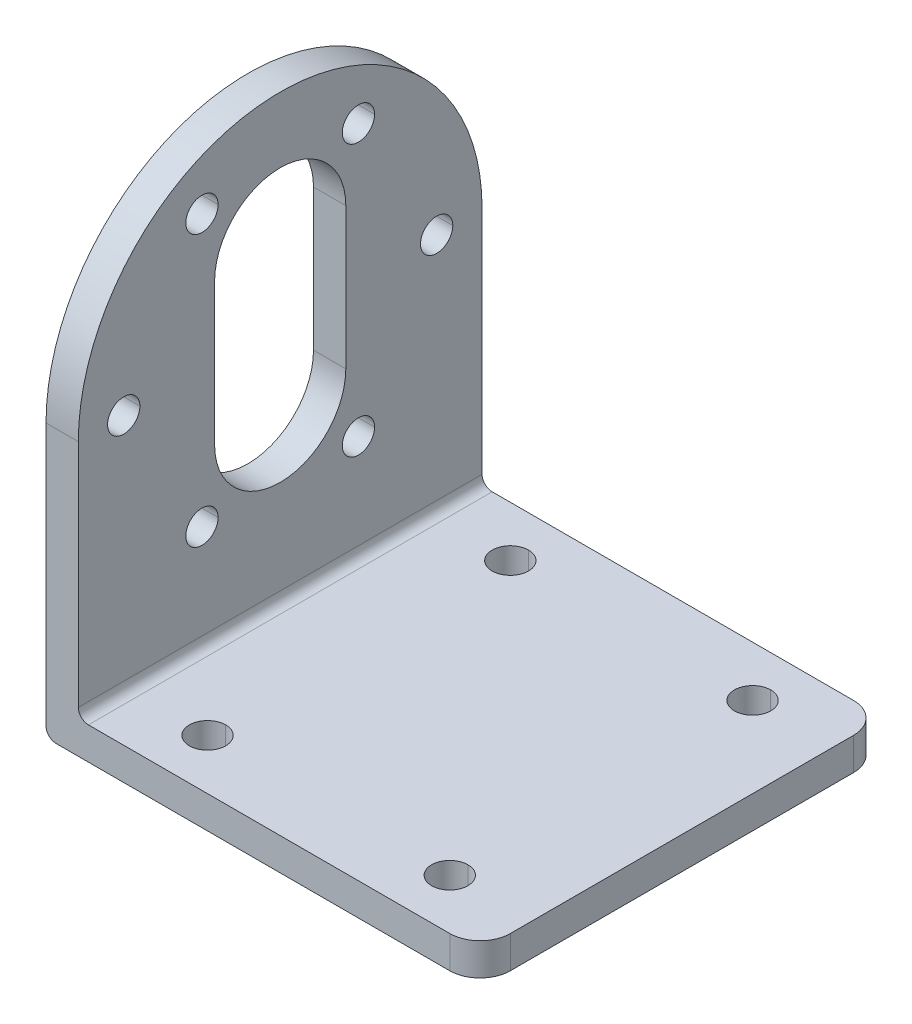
ISO-10303-21;
HEADER;
FILE_DESCRIPTION(('STEP AP214'),'2;1');
FILE_NAME('part.step','',(''),(''),'','','');
FILE_SCHEMA(('AUTOMOTIVE_DESIGN { 1 0 10303 214 1 1 1 1 }'));
ENDSEC;
DATA;
#1=APPLICATION_CONTEXT('core data for automotive mechanical design processes');
#2=APPLICATION_PROTOCOL_DEFINITION('international standard','automotive_design',2000,#1);
#3=PRODUCT_CONTEXT('',#1,'mechanical');
#4=PRODUCT('Part','Part','',(#3));
#5=PRODUCT_RELATED_PRODUCT_CATEGORY('part','',(#4));
#6=PRODUCT_DEFINITION_FORMATION('','',#4);
#7=PRODUCT_DEFINITION_CONTEXT('part definition',#1,'design');
#8=PRODUCT_DEFINITION('design','',#6,#7);
#9=PRODUCT_DEFINITION_SHAPE('','',#8);
#10=(LENGTH_UNIT() NAMED_UNIT(*) SI_UNIT(.MILLI.,.METRE.));
#11=(NAMED_UNIT(*) PLANE_ANGLE_UNIT() SI_UNIT($,.RADIAN.));
#12=(NAMED_UNIT(*) SI_UNIT($,.STERADIAN.) SOLID_ANGLE_UNIT());
#13=UNCERTAINTY_MEASURE_WITH_UNIT(LENGTH_MEASURE(1.E-05),#10,'distance_accuracy_value','');
#14=(GEOMETRIC_REPRESENTATION_CONTEXT(3) GLOBAL_UNCERTAINTY_ASSIGNED_CONTEXT((#13)) GLOBAL_UNIT_ASSIGNED_CONTEXT((#10,
#11,#12)) REPRESENTATION_CONTEXT('',''));
#15=CARTESIAN_POINT('',(0.,0.,0.));
#16=DIRECTION('',(0.,0.,1.));
#17=DIRECTION('',(1.,0.,0.));
#18=AXIS2_PLACEMENT_3D('',#15,#16,#17);
#19=CARTESIAN_POINT('',(-20.5,1.,20.));
#20=DIRECTION('',(0.,0.,-1.));
#21=DIRECTION('',(-1.,0.,0.));
#22=AXIS2_PLACEMENT_3D('',#19,#20,#21);
#23=CYLINDRICAL_SURFACE('',#22,1.);
#24=CARTESIAN_POINT('',(-20.5,1.,-20.));
#25=DIRECTION('',(0.,0.,-1.));
#26=DIRECTION('',(1.,0.,0.));
#27=AXIS2_PLACEMENT_3D('',#24,#25,#26);
#28=CIRCLE('',#27,1.);
#29=CARTESIAN_POINT('',(-20.5,0.,-20.));
#30=VERTEX_POINT('',#29);
#31=CARTESIAN_POINT('',(-21.5,1.,-20.));
#32=VERTEX_POINT('',#31);
#33=EDGE_CURVE('E359',#30,#32,#28,.T.);
#34=ORIENTED_EDGE('',*,*,#33,.F.);
#35=DIRECTION('',(0.,0.,-1.));
#36=VECTOR('',#35,1.);
#37=CARTESIAN_POINT('',(-20.5,0.,-20.));
#38=LINE('',#37,#36);
#39=CARTESIAN_POINT('',(-20.5,0.,20.));
#40=VERTEX_POINT('',#39);
#41=EDGE_CURVE('E369',#40,#30,#38,.T.);
#42=ORIENTED_EDGE('',*,*,#41,.F.);
#43=CARTESIAN_POINT('',(-20.5,1.,20.));
#44=DIRECTION('',(0.,0.,1.));
#45=DIRECTION('',(-1.,0.,0.));
#46=AXIS2_PLACEMENT_3D('',#43,#44,#45);
#47=CIRCLE('',#46,1.);
#48=CARTESIAN_POINT('',(-21.5,1.,20.));
#49=VERTEX_POINT('',#48);
#50=EDGE_CURVE('E492',#49,#40,#47,.T.);
#51=ORIENTED_EDGE('',*,*,#50,.F.);
#52=DIRECTION('',(0.,0.,1.));
#53=VECTOR('',#52,1.);
#54=CARTESIAN_POINT('',(-21.5,1.,20.));
#55=LINE('',#54,#53);
#56=EDGE_CURVE('E447',#32,#49,#55,.T.);
#57=ORIENTED_EDGE('',*,*,#56,.F.);
#58=EDGE_LOOP('',(#34,#42,#51,#57));
#59=FACE_BOUND('',#58,.T.);
#60=ADVANCED_FACE('F16',(#59),#23,.T.);
#61=CARTESIAN_POINT('',(-17.3,4.2,20.));
#62=DIRECTION('',(0.,0.,1.));
#63=DIRECTION('',(1.,0.,0.));
#64=AXIS2_PLACEMENT_3D('',#61,#62,#63);
#65=CYLINDRICAL_SURFACE('',#64,1.);
#66=CARTESIAN_POINT('',(-17.3,4.2,20.));
#67=DIRECTION('',(0.,0.,-1.));
#68=DIRECTION('',(-1.,0.,0.));
#69=AXIS2_PLACEMENT_3D('',#66,#67,#68);
#70=CIRCLE('',#69,1.);
#71=CARTESIAN_POINT('',(-17.3,3.2,20.));
#72=VERTEX_POINT('',#71);
#73=CARTESIAN_POINT('',(-18.3,4.2,20.));
#74=VERTEX_POINT('',#73);
#75=EDGE_CURVE('E510',#72,#74,#70,.T.);
#76=ORIENTED_EDGE('',*,*,#75,.F.);
#77=DIRECTION('',(0.,0.,1.));
#78=VECTOR('',#77,1.);
#79=CARTESIAN_POINT('',(-17.3,3.2,20.));
#80=LINE('',#79,#78);
#81=CARTESIAN_POINT('',(-17.3,3.2,-20.));
#82=VERTEX_POINT('',#81);
#83=EDGE_CURVE('E398',#82,#72,#80,.T.);
#84=ORIENTED_EDGE('',*,*,#83,.F.);
#85=CARTESIAN_POINT('',(-17.3,4.2,-20.));
#86=DIRECTION('',(0.,0.,1.));
#87=DIRECTION('',(1.,0.,0.));
#88=AXIS2_PLACEMENT_3D('',#85,#86,#87);
#89=CIRCLE('',#88,1.);
#90=CARTESIAN_POINT('',(-18.3,4.2,-20.));
#91=VERTEX_POINT('',#90);
#92=EDGE_CURVE('E439',#91,#82,#89,.T.);
#93=ORIENTED_EDGE('',*,*,#92,.F.);
#94=DIRECTION('',(0.,0.,-1.));
#95=VECTOR('',#94,1.);
#96=CARTESIAN_POINT('',(-18.3,4.2,-20.));
#97=LINE('',#96,#95);
#98=EDGE_CURVE('E186',#74,#91,#97,.T.);
#99=ORIENTED_EDGE('',*,*,#98,.F.);
#100=EDGE_LOOP('',(#76,#84,#93,#99));
#101=FACE_BOUND('',#100,.T.);
#102=ADVANCED_FACE('F601',(#101),#65,.F.);
#103=CARTESIAN_POINT('',(-21.501,27.,15.4999999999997));
#104=DIRECTION('',(1.,0.,0.));
#105=DIRECTION('',(0.,0.,-1.));
#106=AXIS2_PLACEMENT_3D('',#103,#104,#105);
#107=CYLINDRICAL_SURFACE('',#106,1.6);
#108=DIRECTION('',(1.,0.,0.));
#109=VECTOR('',#108,1.);
#110=CARTESIAN_POINT('',(-21.501,27.,17.0999999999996));
#111=LINE('',#110,#109);
#112=CARTESIAN_POINT('',(-21.5,27.,17.0999999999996));
#113=VERTEX_POINT('',#112);
#114=CARTESIAN_POINT('',(-18.3,27.,17.0999999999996));
#115=VERTEX_POINT('',#114);
#116=EDGE_CURVE('E726',#113,#115,#111,.T.);
#117=ORIENTED_EDGE('',*,*,#116,.F.);
#118=CARTESIAN_POINT('',(-21.5,27.,15.4999999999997));
#119=DIRECTION('',(-1.,0.,0.));
#120=DIRECTION('',(0.,0.,-1.));
#121=AXIS2_PLACEMENT_3D('',#118,#119,#120);
#122=CIRCLE('',#121,1.6);
#123=CARTESIAN_POINT('',(-21.5,27.,13.8999999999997));
#124=VERTEX_POINT('',#123);
#125=EDGE_CURVE('E458',#113,#124,#122,.T.);
#126=ORIENTED_EDGE('',*,*,#125,.T.);
#127=DIRECTION('',(1.,0.,0.));
#128=VECTOR('',#127,1.);
#129=CARTESIAN_POINT('',(-21.501,27.,13.8999999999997));
#130=LINE('',#129,#128);
#131=CARTESIAN_POINT('',(-18.3,27.,13.8999999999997));
#132=VERTEX_POINT('',#131);
#133=EDGE_CURVE('E657',#124,#132,#130,.T.);
#134=ORIENTED_EDGE('',*,*,#133,.T.);
#135=CARTESIAN_POINT('',(-18.3,27.,15.4999999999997));
#136=DIRECTION('',(1.,0.,0.));
#137=DIRECTION('',(0.,0.,-1.));
#138=AXIS2_PLACEMENT_3D('',#135,#136,#137);
#139=CIRCLE('',#138,1.6);
#140=EDGE_CURVE('E479',#132,#115,#139,.T.);
#141=ORIENTED_EDGE('',*,*,#140,.T.);
#142=EDGE_LOOP('',(#117,#126,#134,#141));
#143=FACE_BOUND('',#142,.T.);
#144=ADVANCED_FACE('F739',(#143),#107,.F.);
#145=CARTESIAN_POINT('',(-21.501,13.5766062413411,7.74999999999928));
#146=DIRECTION('',(1.,0.,0.));
#147=DIRECTION('',(0.,0.,-1.));
#148=AXIS2_PLACEMENT_3D('',#145,#146,#147);
#149=CYLINDRICAL_SURFACE('',#148,1.6);
#150=DIRECTION('',(1.,0.,0.));
#151=VECTOR('',#150,1.);
#152=CARTESIAN_POINT('',(-21.501,13.5766062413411,9.34999999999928));
#153=LINE('',#152,#151);
#154=CARTESIAN_POINT('',(-21.5,13.5766062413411,9.34999999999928));
#155=VERTEX_POINT('',#154);
#156=CARTESIAN_POINT('',(-18.3,13.5766062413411,9.34999999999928));
#157=VERTEX_POINT('',#156);
#158=EDGE_CURVE('E660',#155,#157,#153,.T.);
#159=ORIENTED_EDGE('',*,*,#158,.F.);
#160=CARTESIAN_POINT('',(-21.5,13.5766062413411,7.74999999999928));
#161=DIRECTION('',(-1.,0.,0.));
#162=DIRECTION('',(0.,0.,-1.));
#163=AXIS2_PLACEMENT_3D('',#160,#161,#162);
#164=CIRCLE('',#163,1.6);
#165=CARTESIAN_POINT('',(-21.5,13.5766062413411,6.14999999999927));
#166=VERTEX_POINT('',#165);
#167=EDGE_CURVE('E465',#155,#166,#164,.T.);
#168=ORIENTED_EDGE('',*,*,#167,.T.);
#169=DIRECTION('',(1.,0.,0.));
#170=VECTOR('',#169,1.);
#171=CARTESIAN_POINT('',(-21.501,13.5766062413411,6.14999999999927));
#172=LINE('',#171,#170);
#173=CARTESIAN_POINT('',(-18.3,13.5766062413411,6.14999999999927));
#174=VERTEX_POINT('',#173);
#175=EDGE_CURVE('E671',#166,#174,#172,.T.);
#176=ORIENTED_EDGE('',*,*,#175,.T.);
#177=CARTESIAN_POINT('',(-18.3,13.5766062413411,7.74999999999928));
#178=DIRECTION('',(1.,0.,0.));
#179=DIRECTION('',(0.,0.,-1.));
#180=AXIS2_PLACEMENT_3D('',#177,#178,#179);
#181=CIRCLE('',#180,1.6);
#182=EDGE_CURVE('E474',#174,#157,#181,.T.);
#183=ORIENTED_EDGE('',*,*,#182,.T.);
#184=EDGE_LOOP('',(#159,#168,#176,#183));
#185=FACE_BOUND('',#184,.T.);
#186=ADVANCED_FACE('F822',(#185),#149,.F.);
#187=CARTESIAN_POINT('',(-21.501,13.5766062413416,-7.75000000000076));
#188=DIRECTION('',(1.,0.,0.));
#189=DIRECTION('',(0.,0.,-1.));
#190=AXIS2_PLACEMENT_3D('',#187,#188,#189);
#191=CYLINDRICAL_SURFACE('',#190,1.6);
#192=DIRECTION('',(1.,0.,0.));
#193=VECTOR('',#192,1.);
#194=CARTESIAN_POINT('',(-21.501,13.5766062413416,-6.15000000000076));
#195=LINE('',#194,#193);
#196=CARTESIAN_POINT('',(-21.5,13.5766062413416,-6.15000000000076));
#197=VERTEX_POINT('',#196);
#198=CARTESIAN_POINT('',(-18.3,13.5766062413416,-6.15000000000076));
#199=VERTEX_POINT('',#198);
#200=EDGE_CURVE('E668',#197,#199,#195,.T.);
#201=ORIENTED_EDGE('',*,*,#200,.F.);
#202=CARTESIAN_POINT('',(-21.5,13.5766062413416,-7.75000000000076));
#203=DIRECTION('',(-1.,0.,0.));
#204=DIRECTION('',(0.,0.,-1.));
#205=AXIS2_PLACEMENT_3D('',#202,#203,#204);
#206=CIRCLE('',#205,1.6);
#207=CARTESIAN_POINT('',(-21.5,13.5766062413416,-9.35000000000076));
#208=VERTEX_POINT('',#207);
#209=EDGE_CURVE('E466',#197,#208,#206,.T.);
#210=ORIENTED_EDGE('',*,*,#209,.T.);
#211=DIRECTION('',(1.,0.,0.));
#212=VECTOR('',#211,1.);
#213=CARTESIAN_POINT('',(-21.501,13.5766062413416,-9.35000000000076));
#214=LINE('',#213,#212);
#215=CARTESIAN_POINT('',(-18.3,13.5766062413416,-9.35000000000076));
#216=VERTEX_POINT('',#215);
#217=EDGE_CURVE('E662',#208,#216,#214,.T.);
#218=ORIENTED_EDGE('',*,*,#217,.T.);
#219=CARTESIAN_POINT('',(-18.3,13.5766062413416,-7.75000000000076));
#220=DIRECTION('',(1.,0.,0.));
#221=DIRECTION('',(0.,0.,-1.));
#222=AXIS2_PLACEMENT_3D('',#219,#220,#221);
#223=CIRCLE('',#222,1.6);
#224=EDGE_CURVE('E476',#216,#199,#223,.T.);
#225=ORIENTED_EDGE('',*,*,#224,.T.);
#226=EDGE_LOOP('',(#201,#210,#218,#225));
#227=FACE_BOUND('',#226,.T.);
#228=ADVANCED_FACE('F1345',(#227),#191,.F.);
#229=CARTESIAN_POINT('',(-21.501,27.0000000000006,-15.5000000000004));
#230=DIRECTION('',(1.,0.,0.));
#231=DIRECTION('',(0.,0.,-1.));
#232=AXIS2_PLACEMENT_3D('',#229,#230,#231);
#233=CYLINDRICAL_SURFACE('',#232,1.6);
#234=DIRECTION('',(1.,0.,0.));
#235=VECTOR('',#234,1.);
#236=CARTESIAN_POINT('',(-21.501,27.0000000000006,-13.9000000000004));
#237=LINE('',#236,#235);
#238=CARTESIAN_POINT('',(-21.5,27.0000000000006,-13.9000000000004));
#239=VERTEX_POINT('',#238);
#240=CARTESIAN_POINT('',(-18.3,27.0000000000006,-13.9000000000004));
#241=VERTEX_POINT('',#240);
#242=EDGE_CURVE('E694',#239,#241,#237,.T.);
#243=ORIENTED_EDGE('',*,*,#242,.F.);
#244=CARTESIAN_POINT('',(-21.5,27.0000000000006,-15.5000000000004));
#245=DIRECTION('',(-1.,0.,0.));
#246=DIRECTION('',(0.,0.,-1.));
#247=AXIS2_PLACEMENT_3D('',#244,#245,#246);
#248=CIRCLE('',#247,1.6);
#249=CARTESIAN_POINT('',(-21.5,27.0000000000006,-17.1000000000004));
#250=VERTEX_POINT('',#249);
#251=EDGE_CURVE('E467',#239,#250,#248,.T.);
#252=ORIENTED_EDGE('',*,*,#251,.T.);
#253=DIRECTION('',(1.,0.,0.));
#254=VECTOR('',#253,1.);
#255=CARTESIAN_POINT('',(-21.501,27.0000000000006,-17.1000000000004));
#256=LINE('',#255,#254);
#257=CARTESIAN_POINT('',(-18.3,27.0000000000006,-17.1000000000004));
#258=VERTEX_POINT('',#257);
#259=EDGE_CURVE('E633',#250,#258,#256,.T.);
#260=ORIENTED_EDGE('',*,*,#259,.T.);
#261=CARTESIAN_POINT('',(-18.3,27.0000000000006,-15.5000000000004));
#262=DIRECTION('',(1.,0.,0.));
#263=DIRECTION('',(0.,0.,-1.));
#264=AXIS2_PLACEMENT_3D('',#261,#262,#263);
#265=CIRCLE('',#264,1.6);
#266=EDGE_CURVE('E535',#258,#241,#265,.T.);
#267=ORIENTED_EDGE('',*,*,#266,.T.);
#268=EDGE_LOOP('',(#243,#252,#260,#267));
#269=FACE_BOUND('',#268,.T.);
#270=ADVANCED_FACE('F716',(#269),#233,.F.);
#271=CARTESIAN_POINT('',(-21.501,40.4233937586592,-7.75));
#272=DIRECTION('',(1.,0.,0.));
#273=DIRECTION('',(0.,0.,-1.));
#274=AXIS2_PLACEMENT_3D('',#271,#272,#273);
#275=CYLINDRICAL_SURFACE('',#274,1.6);
#276=DIRECTION('',(1.,0.,0.));
#277=VECTOR('',#276,1.);
#278=CARTESIAN_POINT('',(-21.501,40.4233937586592,-6.15));
#279=LINE('',#278,#277);
#280=CARTESIAN_POINT('',(-21.5,40.4233937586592,-6.15));
#281=VERTEX_POINT('',#280);
#282=CARTESIAN_POINT('',(-18.3,40.4233937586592,-6.15));
#283=VERTEX_POINT('',#282);
#284=EDGE_CURVE('E635',#281,#283,#279,.T.);
#285=ORIENTED_EDGE('',*,*,#284,.F.);
#286=CARTESIAN_POINT('',(-21.5,40.4233937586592,-7.75));
#287=DIRECTION('',(-1.,0.,0.));
#288=DIRECTION('',(0.,0.,-1.));
#289=AXIS2_PLACEMENT_3D('',#286,#287,#288);
#290=CIRCLE('',#289,1.6);
#291=CARTESIAN_POINT('',(-21.5,40.4233937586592,-9.35));
#292=VERTEX_POINT('',#291);
#293=EDGE_CURVE('E475',#281,#292,#290,.T.);
#294=ORIENTED_EDGE('',*,*,#293,.T.);
#295=DIRECTION('',(1.,0.,0.));
#296=VECTOR('',#295,1.);
#297=CARTESIAN_POINT('',(-21.501,40.4233937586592,-9.35));
#298=LINE('',#297,#296);
#299=CARTESIAN_POINT('',(-18.3,40.4233937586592,-9.35));
#300=VERTEX_POINT('',#299);
#301=EDGE_CURVE('E562',#292,#300,#298,.T.);
#302=ORIENTED_EDGE('',*,*,#301,.T.);
#303=CARTESIAN_POINT('',(-18.3,40.4233937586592,-7.75));
#304=DIRECTION('',(1.,0.,0.));
#305=DIRECTION('',(0.,0.,-1.));
#306=AXIS2_PLACEMENT_3D('',#303,#304,#305);
#307=CIRCLE('',#306,1.6);
#308=EDGE_CURVE('E518',#300,#283,#307,.T.);
#309=ORIENTED_EDGE('',*,*,#308,.T.);
#310=EDGE_LOOP('',(#285,#294,#302,#309));
#311=FACE_BOUND('',#310,.T.);
#312=ADVANCED_FACE('F1326',(#311),#275,.F.);
#313=CARTESIAN_POINT('',(-21.501,40.4233937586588,7.75));
#314=DIRECTION('',(1.,0.,0.));
#315=DIRECTION('',(0.,0.,-1.));
#316=AXIS2_PLACEMENT_3D('',#313,#314,#315);
#317=CYLINDRICAL_SURFACE('',#316,1.6);
#318=DIRECTION('',(1.,0.,0.));
#319=VECTOR('',#318,1.);
#320=CARTESIAN_POINT('',(-21.501,40.4233937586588,9.35));
#321=LINE('',#320,#319);
#322=CARTESIAN_POINT('',(-21.5,40.4233937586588,9.35));
#323=VERTEX_POINT('',#322);
#324=CARTESIAN_POINT('',(-18.3,40.4233937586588,9.35));
#325=VERTEX_POINT('',#324);
#326=EDGE_CURVE('E560',#323,#325,#321,.T.);
#327=ORIENTED_EDGE('',*,*,#326,.F.);
#328=CARTESIAN_POINT('',(-21.5,40.4233937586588,7.75));
#329=DIRECTION('',(-1.,0.,0.));
#330=DIRECTION('',(0.,0.,-1.));
#331=AXIS2_PLACEMENT_3D('',#328,#329,#330);
#332=CIRCLE('',#331,1.6);
#333=CARTESIAN_POINT('',(-21.5,40.4233937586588,6.15));
#334=VERTEX_POINT('',#333);
#335=EDGE_CURVE('E469',#323,#334,#332,.T.);
#336=ORIENTED_EDGE('',*,*,#335,.T.);
#337=DIRECTION('',(1.,0.,0.));
#338=VECTOR('',#337,1.);
#339=CARTESIAN_POINT('',(-21.501,40.4233937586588,6.15));
#340=LINE('',#339,#338);
#341=CARTESIAN_POINT('',(-18.3,40.4233937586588,6.15));
#342=VERTEX_POINT('',#341);
#343=EDGE_CURVE('E567',#334,#342,#340,.T.);
#344=ORIENTED_EDGE('',*,*,#343,.T.);
#345=CARTESIAN_POINT('',(-18.3,40.4233937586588,7.75));
#346=DIRECTION('',(1.,0.,0.));
#347=DIRECTION('',(0.,0.,-1.));
#348=AXIS2_PLACEMENT_3D('',#345,#346,#347);
#349=CIRCLE('',#348,1.6);
#350=EDGE_CURVE('E426',#342,#325,#349,.T.);
#351=ORIENTED_EDGE('',*,*,#350,.T.);
#352=EDGE_LOOP('',(#327,#336,#344,#351));
#353=FACE_BOUND('',#352,.T.);
#354=ADVANCED_FACE('F1317',(#353),#317,.F.);
#355=CARTESIAN_POINT('',(-21.501,34.,6.5));
#356=DIRECTION('',(0.,0.,1.));
#357=DIRECTION('',(1.,0.,0.));
#358=AXIS2_PLACEMENT_3D('',#355,#356,#357);
#359=PLANE('',#358);
#360=DIRECTION('',(0.,1.,0.));
#361=VECTOR('',#360,1.);
#362=CARTESIAN_POINT('',(-21.5,34.,6.5));
#363=LINE('',#362,#361);
#364=CARTESIAN_POINT('',(-21.5,20.,6.5));
#365=VERTEX_POINT('',#364);
#366=CARTESIAN_POINT('',(-21.5,34.,6.5));
#367=VERTEX_POINT('',#366);
#368=EDGE_CURVE('E486',#365,#367,#363,.T.);
#369=ORIENTED_EDGE('',*,*,#368,.T.);
#370=DIRECTION('',(1.,0.,0.));
#371=VECTOR('',#370,1.);
#372=CARTESIAN_POINT('',(-21.501,34.,6.5));
#373=LINE('',#372,#371);
#374=CARTESIAN_POINT('',(-18.3,34.,6.5));
#375=VERTEX_POINT('',#374);
#376=EDGE_CURVE('E94',#367,#375,#373,.T.);
#377=ORIENTED_EDGE('',*,*,#376,.T.);
#378=DIRECTION('',(0.,-1.,0.));
#379=VECTOR('',#378,1.);
#380=CARTESIAN_POINT('',(-18.3,34.,6.5));
#381=LINE('',#380,#379);
#382=CARTESIAN_POINT('',(-18.3,20.,6.5));
#383=VERTEX_POINT('',#382);
#384=EDGE_CURVE('E425',#375,#383,#381,.T.);
#385=ORIENTED_EDGE('',*,*,#384,.T.);
#386=DIRECTION('',(1.,0.,0.));
#387=VECTOR('',#386,1.);
#388=CARTESIAN_POINT('',(-21.501,20.,6.5));
#389=LINE('',#388,#387);
#390=EDGE_CURVE('E10',#365,#383,#389,.T.);
#391=ORIENTED_EDGE('',*,*,#390,.F.);
#392=EDGE_LOOP('',(#369,#377,#385,#391));
#393=FACE_BOUND('',#392,.T.);
#394=ADVANCED_FACE('F1309',(#393),#359,.F.);
#395=CARTESIAN_POINT('',(-21.501,20.,0.));
#396=DIRECTION('',(1.,0.,0.));
#397=DIRECTION('',(0.,0.,-1.));
#398=AXIS2_PLACEMENT_3D('',#395,#396,#397);
#399=CYLINDRICAL_SURFACE('',#398,6.5);
#400=CARTESIAN_POINT('',(-21.5,20.,0.));
#401=DIRECTION('',(-1.,0.,0.));
#402=DIRECTION('',(0.,0.,-1.));
#403=AXIS2_PLACEMENT_3D('',#400,#401,#402);
#404=CIRCLE('',#403,6.5);
#405=CARTESIAN_POINT('',(-21.5,20.,-6.5));
#406=VERTEX_POINT('',#405);
#407=EDGE_CURVE('E487',#406,#365,#404,.T.);
#408=ORIENTED_EDGE('',*,*,#407,.T.);
#409=ORIENTED_EDGE('',*,*,#390,.T.);
#410=CARTESIAN_POINT('',(-18.3,20.,0.));
#411=DIRECTION('',(1.,0.,0.));
#412=DIRECTION('',(0.,0.,-1.));
#413=AXIS2_PLACEMENT_3D('',#410,#411,#412);
#414=CIRCLE('',#413,6.5);
#415=CARTESIAN_POINT('',(-18.3,20.,-6.5));
#416=VERTEX_POINT('',#415);
#417=EDGE_CURVE('E498',#383,#416,#414,.T.);
#418=ORIENTED_EDGE('',*,*,#417,.T.);
#419=DIRECTION('',(1.,0.,0.));
#420=VECTOR('',#419,1.);
#421=CARTESIAN_POINT('',(-21.501,20.,-6.5));
#422=LINE('',#421,#420);
#423=EDGE_CURVE('E19',#406,#416,#422,.T.);
#424=ORIENTED_EDGE('',*,*,#423,.F.);
#425=EDGE_LOOP('',(#408,#409,#418,#424));
#426=FACE_BOUND('',#425,.T.);
#427=ADVANCED_FACE('F1305',(#426),#399,.F.);
#428=CARTESIAN_POINT('',(-21.501,34.,-6.5));
#429=DIRECTION('',(0.,0.,-1.));
#430=DIRECTION('',(0.,-1.,0.));
#431=AXIS2_PLACEMENT_3D('',#428,#429,#430);
#432=PLANE('',#431);
#433=DIRECTION('',(0.,-1.,0.));
#434=VECTOR('',#433,1.);
#435=CARTESIAN_POINT('',(-21.5,34.,-6.5));
#436=LINE('',#435,#434);
#437=CARTESIAN_POINT('',(-21.5,34.,-6.5));
#438=VERTEX_POINT('',#437);
#439=EDGE_CURVE('E471',#438,#406,#436,.T.);
#440=ORIENTED_EDGE('',*,*,#439,.T.);
#441=ORIENTED_EDGE('',*,*,#423,.T.);
#442=DIRECTION('',(0.,1.,0.));
#443=VECTOR('',#442,1.);
#444=CARTESIAN_POINT('',(-18.3,34.,-6.5));
#445=LINE('',#444,#443);
#446=CARTESIAN_POINT('',(-18.3,34.,-6.5));
#447=VERTEX_POINT('',#446);
#448=EDGE_CURVE('E534',#416,#447,#445,.T.);
#449=ORIENTED_EDGE('',*,*,#448,.T.);
#450=DIRECTION('',(1.,0.,0.));
#451=VECTOR('',#450,1.);
#452=CARTESIAN_POINT('',(-21.501,34.,-6.5));
#453=LINE('',#452,#451);
#454=EDGE_CURVE('E410',#438,#447,#453,.T.);
#455=ORIENTED_EDGE('',*,*,#454,.F.);
#456=EDGE_LOOP('',(#440,#441,#449,#455));
#457=FACE_BOUND('',#456,.T.);
#458=ADVANCED_FACE('F1293',(#457),#432,.F.);
#459=CARTESIAN_POINT('',(-21.501,34.,0.));
#460=DIRECTION('',(1.,0.,0.));
#461=DIRECTION('',(0.,0.,-1.));
#462=AXIS2_PLACEMENT_3D('',#459,#460,#461);
#463=CYLINDRICAL_SURFACE('',#462,6.5);
#464=CARTESIAN_POINT('',(-21.5,34.,0.));
#465=DIRECTION('',(-1.,0.,0.));
#466=DIRECTION('',(0.,0.,-1.));
#467=AXIS2_PLACEMENT_3D('',#464,#465,#466);
#468=CIRCLE('',#467,6.5);
#469=EDGE_CURVE('E485',#367,#438,#468,.T.);
#470=ORIENTED_EDGE('',*,*,#469,.T.);
#471=ORIENTED_EDGE('',*,*,#454,.T.);
#472=CARTESIAN_POINT('',(-18.3,34.,0.));
#473=DIRECTION('',(1.,0.,0.));
#474=DIRECTION('',(0.,0.,-1.));
#475=AXIS2_PLACEMENT_3D('',#472,#473,#474);
#476=CIRCLE('',#475,6.5);
#477=EDGE_CURVE('E422',#447,#375,#476,.T.);
#478=ORIENTED_EDGE('',*,*,#477,.T.);
#479=ORIENTED_EDGE('',*,*,#376,.F.);
#480=EDGE_LOOP('',(#470,#471,#478,#479));
#481=FACE_BOUND('',#480,.T.);
#482=ADVANCED_FACE('F1282',(#481),#463,.F.);
#483=CARTESIAN_POINT('',(18.5,3.2,-17.));
#484=DIRECTION('',(0.,-1.,0.));
#485=DIRECTION('',(0.,0.,-1.));
#486=AXIS2_PLACEMENT_3D('',#483,#484,#485);
#487=CYLINDRICAL_SURFACE('',#486,3.);
#488=CARTESIAN_POINT('',(18.5,3.2,-17.));
#489=DIRECTION('',(0.,1.,0.));
#490=DIRECTION('',(0.,0.,-1.));
#491=AXIS2_PLACEMENT_3D('',#488,#489,#490);
#492=CIRCLE('',#491,3.);
#493=CARTESIAN_POINT('',(21.5,3.2,-17.));
#494=VERTEX_POINT('',#493);
#495=CARTESIAN_POINT('',(18.5,3.2,-20.));
#496=VERTEX_POINT('',#495);
#497=EDGE_CURVE('E415',#494,#496,#492,.T.);
#498=ORIENTED_EDGE('',*,*,#497,.F.);
#499=DIRECTION('',(0.,1.,0.));
#500=VECTOR('',#499,1.);
#501=CARTESIAN_POINT('',(21.5,3.2,-17.));
#502=LINE('',#501,#500);
#503=CARTESIAN_POINT('',(21.5,0.,-17.));
#504=VERTEX_POINT('',#503);
#505=EDGE_CURVE('E423',#504,#494,#502,.T.);
#506=ORIENTED_EDGE('',*,*,#505,.F.);
#507=CARTESIAN_POINT('',(18.5,0.,-17.));
#508=DIRECTION('',(0.,-1.,0.));
#509=DIRECTION('',(0.,0.,-1.));
#510=AXIS2_PLACEMENT_3D('',#507,#508,#509);
#511=CIRCLE('',#510,3.);
#512=CARTESIAN_POINT('',(18.5,0.,-20.));
#513=VERTEX_POINT('',#512);
#514=EDGE_CURVE('E364',#513,#504,#511,.T.);
#515=ORIENTED_EDGE('',*,*,#514,.F.);
#516=DIRECTION('',(0.,-1.,0.));
#517=VECTOR('',#516,1.);
#518=CARTESIAN_POINT('',(18.5,3.2,-20.));
#519=LINE('',#518,#517);
#520=EDGE_CURVE('E444',#496,#513,#519,.T.);
#521=ORIENTED_EDGE('',*,*,#520,.F.);
#522=EDGE_LOOP('',(#498,#506,#515,#521));
#523=FACE_BOUND('',#522,.T.);
#524=ADVANCED_FACE('F1149',(#523),#487,.T.);
#525=CARTESIAN_POINT('',(18.5,3.2,17.));
#526=DIRECTION('',(0.,-1.,0.));
#527=DIRECTION('',(0.,0.,-1.));
#528=AXIS2_PLACEMENT_3D('',#525,#526,#527);
#529=CYLINDRICAL_SURFACE('',#528,3.);
#530=CARTESIAN_POINT('',(18.5,3.2,17.));
#531=DIRECTION('',(0.,1.,0.));
#532=DIRECTION('',(0.,0.,-1.));
#533=AXIS2_PLACEMENT_3D('',#530,#531,#532);
#534=CIRCLE('',#533,3.);
#535=CARTESIAN_POINT('',(18.5,3.2,20.));
#536=VERTEX_POINT('',#535);
#537=CARTESIAN_POINT('',(21.5,3.2,17.));
#538=VERTEX_POINT('',#537);
#539=EDGE_CURVE('E396',#536,#538,#534,.T.);
#540=ORIENTED_EDGE('',*,*,#539,.F.);
#541=DIRECTION('',(0.,1.,0.));
#542=VECTOR('',#541,1.);
#543=CARTESIAN_POINT('',(18.5,3.2,20.));
#544=LINE('',#543,#542);
#545=CARTESIAN_POINT('',(18.5,0.,20.));
#546=VERTEX_POINT('',#545);
#547=EDGE_CURVE('E503',#546,#536,#544,.T.);
#548=ORIENTED_EDGE('',*,*,#547,.F.);
#549=CARTESIAN_POINT('',(18.5,0.,17.));
#550=DIRECTION('',(0.,-1.,0.));
#551=DIRECTION('',(0.,0.,-1.));
#552=AXIS2_PLACEMENT_3D('',#549,#550,#551);
#553=CIRCLE('',#552,3.);
#554=CARTESIAN_POINT('',(21.5,0.,17.));
#555=VERTEX_POINT('',#554);
#556=EDGE_CURVE('E366',#555,#546,#553,.T.);
#557=ORIENTED_EDGE('',*,*,#556,.F.);
#558=DIRECTION('',(0.,-1.,0.));
#559=VECTOR('',#558,1.);
#560=CARTESIAN_POINT('',(21.5,3.2,17.));
#561=LINE('',#560,#559);
#562=EDGE_CURVE('E373',#538,#555,#561,.T.);
#563=ORIENTED_EDGE('',*,*,#562,.F.);
#564=EDGE_LOOP('',(#540,#548,#557,#563));
#565=FACE_BOUND('',#564,.T.);
#566=ADVANCED_FACE('F611',(#565),#529,.T.);
#567=CARTESIAN_POINT('',(-10.5,0.,-15.));
#568=DIRECTION('',(0.,1.,0.));
#569=DIRECTION('',(0.,0.,1.));
#570=AXIS2_PLACEMENT_3D('',#567,#568,#569);
#571=CYLINDRICAL_SURFACE('',#570,1.8);
#572=DIRECTION('',(0.,1.,0.));
#573=VECTOR('',#572,1.);
#574=CARTESIAN_POINT('',(-10.5,0.,-16.8));
#575=LINE('',#574,#573);
#576=CARTESIAN_POINT('',(-10.5,0.,-16.8));
#577=VERTEX_POINT('',#576);
#578=CARTESIAN_POINT('',(-10.5,3.2,-16.8));
#579=VERTEX_POINT('',#578);
#580=EDGE_CURVE('E577',#577,#579,#575,.T.);
#581=ORIENTED_EDGE('',*,*,#580,.F.);
#582=CARTESIAN_POINT('',(-10.5,0.,-15.));
#583=DIRECTION('',(0.,1.,0.));
#584=DIRECTION('',(0.,0.,1.));
#585=AXIS2_PLACEMENT_3D('',#582,#583,#584);
#586=CIRCLE('',#585,1.8);
#587=CARTESIAN_POINT('',(-10.5,0.,-13.2));
#588=VERTEX_POINT('',#587);
#589=EDGE_CURVE('E325',#588,#577,#586,.T.);
#590=ORIENTED_EDGE('',*,*,#589,.F.);
#591=DIRECTION('',(0.,1.,0.));
#592=VECTOR('',#591,1.);
#593=CARTESIAN_POINT('',(-10.5,0.,-13.2));
#594=LINE('',#593,#592);
#595=CARTESIAN_POINT('',(-10.5,3.2,-13.2));
#596=VERTEX_POINT('',#595);
#597=EDGE_CURVE('E333',#588,#596,#594,.T.);
#598=ORIENTED_EDGE('',*,*,#597,.T.);
#599=CARTESIAN_POINT('',(-10.5,3.2,-15.));
#600=DIRECTION('',(0.,1.,0.));
#601=DIRECTION('',(0.,0.,1.));
#602=AXIS2_PLACEMENT_3D('',#599,#600,#601);
#603=CIRCLE('',#602,1.8);
#604=EDGE_CURVE('E407',#596,#579,#603,.T.);
#605=ORIENTED_EDGE('',*,*,#604,.T.);
#606=EDGE_LOOP('',(#581,#590,#598,#605));
#607=FACE_BOUND('',#606,.T.);
#608=ADVANCED_FACE('F1147',(#607),#571,.F.);
#609=CARTESIAN_POINT('',(-10.5,0.,15.));
#610=DIRECTION('',(0.,1.,0.));
#611=DIRECTION('',(0.,0.,1.));
#612=AXIS2_PLACEMENT_3D('',#609,#610,#611);
#613=CYLINDRICAL_SURFACE('',#612,1.8);
#614=DIRECTION('',(0.,1.,0.));
#615=VECTOR('',#614,1.);
#616=CARTESIAN_POINT('',(-10.5,0.,13.2));
#617=LINE('',#616,#615);
#618=CARTESIAN_POINT('',(-10.5,0.,13.2));
#619=VERTEX_POINT('',#618);
#620=CARTESIAN_POINT('',(-10.5,3.2,13.2));
#621=VERTEX_POINT('',#620);
#622=EDGE_CURVE('E318',#619,#621,#617,.T.);
#623=ORIENTED_EDGE('',*,*,#622,.F.);
#624=CARTESIAN_POINT('',(-10.5,0.,15.));
#625=DIRECTION('',(0.,1.,0.));
#626=DIRECTION('',(0.,0.,1.));
#627=AXIS2_PLACEMENT_3D('',#624,#625,#626);
#628=CIRCLE('',#627,1.8);
#629=CARTESIAN_POINT('',(-10.5,0.,16.8));
#630=VERTEX_POINT('',#629);
#631=EDGE_CURVE('E307',#630,#619,#628,.T.);
#632=ORIENTED_EDGE('',*,*,#631,.F.);
#633=DIRECTION('',(0.,1.,0.));
#634=VECTOR('',#633,1.);
#635=CARTESIAN_POINT('',(-10.5,0.,16.8));
#636=LINE('',#635,#634);
#637=CARTESIAN_POINT('',(-10.5,3.2,16.8));
#638=VERTEX_POINT('',#637);
#639=EDGE_CURVE('E312',#630,#638,#636,.T.);
#640=ORIENTED_EDGE('',*,*,#639,.T.);
#641=CARTESIAN_POINT('',(-10.5,3.2,15.));
#642=DIRECTION('',(0.,1.,0.));
#643=DIRECTION('',(0.,0.,1.));
#644=AXIS2_PLACEMENT_3D('',#641,#642,#643);
#645=CIRCLE('',#644,1.8);
#646=EDGE_CURVE('E411',#638,#621,#645,.T.);
#647=ORIENTED_EDGE('',*,*,#646,.T.);
#648=EDGE_LOOP('',(#623,#632,#640,#647));
#649=FACE_BOUND('',#648,.T.);
#650=ADVANCED_FACE('F314',(#649),#613,.F.);
#651=CARTESIAN_POINT('',(13.5,0.,15.));
#652=DIRECTION('',(0.,1.,0.));
#653=DIRECTION('',(0.,0.,1.));
#654=AXIS2_PLACEMENT_3D('',#651,#652,#653);
#655=CYLINDRICAL_SURFACE('',#654,1.8);
#656=DIRECTION('',(0.,1.,0.));
#657=VECTOR('',#656,1.);
#658=CARTESIAN_POINT('',(13.5,0.,13.2));
#659=LINE('',#658,#657);
#660=CARTESIAN_POINT('',(13.5,0.,13.2));
#661=VERTEX_POINT('',#660);
#662=CARTESIAN_POINT('',(13.5,3.2,13.2));
#663=VERTEX_POINT('',#662);
#664=EDGE_CURVE('E349',#661,#663,#659,.T.);
#665=ORIENTED_EDGE('',*,*,#664,.F.);
#666=CARTESIAN_POINT('',(13.5,0.,15.));
#667=DIRECTION('',(0.,1.,0.));
#668=DIRECTION('',(0.,0.,1.));
#669=AXIS2_PLACEMENT_3D('',#666,#667,#668);
#670=CIRCLE('',#669,1.8);
#671=CARTESIAN_POINT('',(13.5,0.,16.8));
#672=VERTEX_POINT('',#671);
#673=EDGE_CURVE('E321',#672,#661,#670,.T.);
#674=ORIENTED_EDGE('',*,*,#673,.F.);
#675=DIRECTION('',(0.,1.,0.));
#676=VECTOR('',#675,1.);
#677=CARTESIAN_POINT('',(13.5,0.,16.8));
#678=LINE('',#677,#676);
#679=CARTESIAN_POINT('',(13.5,3.2,16.8));
#680=VERTEX_POINT('',#679);
#681=EDGE_CURVE('E365',#672,#680,#678,.T.);
#682=ORIENTED_EDGE('',*,*,#681,.T.);
#683=CARTESIAN_POINT('',(13.5,3.2,15.));
#684=DIRECTION('',(0.,1.,0.));
#685=DIRECTION('',(0.,0.,1.));
#686=AXIS2_PLACEMENT_3D('',#683,#684,#685);
#687=CIRCLE('',#686,1.8);
#688=EDGE_CURVE('E372',#680,#663,#687,.T.);
#689=ORIENTED_EDGE('',*,*,#688,.T.);
#690=EDGE_LOOP('',(#665,#674,#682,#689));
#691=FACE_BOUND('',#690,.T.);
#692=ADVANCED_FACE('F773',(#691),#655,.F.);
#693=CARTESIAN_POINT('',(13.5,0.,-15.));
#694=DIRECTION('',(0.,1.,0.));
#695=DIRECTION('',(0.,0.,1.));
#696=AXIS2_PLACEMENT_3D('',#693,#694,#695);
#697=CYLINDRICAL_SURFACE('',#696,1.8);
#698=DIRECTION('',(0.,1.,0.));
#699=VECTOR('',#698,1.);
#700=CARTESIAN_POINT('',(13.5,0.,-16.8));
#701=LINE('',#700,#699);
#702=CARTESIAN_POINT('',(13.5,0.,-16.8));
#703=VERTEX_POINT('',#702);
#704=CARTESIAN_POINT('',(13.5,3.2,-16.8));
#705=VERTEX_POINT('',#704);
#706=EDGE_CURVE('E385',#703,#705,#701,.T.);
#707=ORIENTED_EDGE('',*,*,#706,.F.);
#708=CARTESIAN_POINT('',(13.5,0.,-15.));
#709=DIRECTION('',(0.,1.,0.));
#710=DIRECTION('',(0.,0.,1.));
#711=AXIS2_PLACEMENT_3D('',#708,#709,#710);
#712=CIRCLE('',#711,1.8);
#713=CARTESIAN_POINT('',(13.5,0.,-13.2));
#714=VERTEX_POINT('',#713);
#715=EDGE_CURVE('E511',#714,#703,#712,.T.);
#716=ORIENTED_EDGE('',*,*,#715,.F.);
#717=DIRECTION('',(0.,1.,0.));
#718=VECTOR('',#717,1.);
#719=CARTESIAN_POINT('',(13.5,0.,-13.2));
#720=LINE('',#719,#718);
#721=CARTESIAN_POINT('',(13.5,3.2,-13.2));
#722=VERTEX_POINT('',#721);
#723=EDGE_CURVE('E388',#714,#722,#720,.T.);
#724=ORIENTED_EDGE('',*,*,#723,.T.);
#725=CARTESIAN_POINT('',(13.5,3.2,-15.));
#726=DIRECTION('',(0.,1.,0.));
#727=DIRECTION('',(0.,0.,1.));
#728=AXIS2_PLACEMENT_3D('',#725,#726,#727);
#729=CIRCLE('',#728,1.8);
#730=EDGE_CURVE('E367',#722,#705,#729,.T.);
#731=ORIENTED_EDGE('',*,*,#730,.T.);
#732=EDGE_LOOP('',(#707,#716,#724,#731));
#733=FACE_BOUND('',#732,.T.);
#734=ADVANCED_FACE('F1131',(#733),#697,.F.);
#735=CARTESIAN_POINT('',(-66.2213595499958,27.,0.));
#736=DIRECTION('',(1.,0.,0.));
#737=DIRECTION('',(0.,0.,-1.));
#738=AXIS2_PLACEMENT_3D('',#735,#736,#737);
#739=CYLINDRICAL_SURFACE('',#738,20.);
#740=CARTESIAN_POINT('',(-21.5,27.,0.));
#741=DIRECTION('',(-1.,0.,0.));
#742=DIRECTION('',(0.,0.,-1.));
#743=AXIS2_PLACEMENT_3D('',#740,#741,#742);
#744=CIRCLE('',#743,20.);
#745=CARTESIAN_POINT('',(-21.5,27.,20.));
#746=VERTEX_POINT('',#745);
#747=CARTESIAN_POINT('',(-21.5,27.,-20.));
#748=VERTEX_POINT('',#747);
#749=EDGE_CURVE('E453',#746,#748,#744,.T.);
#750=ORIENTED_EDGE('',*,*,#749,.F.);
#751=DIRECTION('',(1.,0.,0.));
#752=VECTOR('',#751,1.);
#753=CARTESIAN_POINT('',(-21.5,27.,20.));
#754=LINE('',#753,#752);
#755=CARTESIAN_POINT('',(-18.3,27.,20.));
#756=VERTEX_POINT('',#755);
#757=EDGE_CURVE('E450',#746,#756,#754,.T.);
#758=ORIENTED_EDGE('',*,*,#757,.T.);
#759=CARTESIAN_POINT('',(-18.3,27.,0.));
#760=DIRECTION('',(1.,0.,0.));
#761=DIRECTION('',(0.,0.,-1.));
#762=AXIS2_PLACEMENT_3D('',#759,#760,#761);
#763=CIRCLE('',#762,20.);
#764=CARTESIAN_POINT('',(-18.3,27.,-20.));
#765=VERTEX_POINT('',#764);
#766=EDGE_CURVE('E85',#765,#756,#763,.T.);
#767=ORIENTED_EDGE('',*,*,#766,.F.);
#768=DIRECTION('',(-1.,0.,0.));
#769=VECTOR('',#768,1.);
#770=CARTESIAN_POINT('',(-21.5,27.,-20.));
#771=LINE('',#770,#769);
#772=EDGE_CURVE('E357',#765,#748,#771,.T.);
#773=ORIENTED_EDGE('',*,*,#772,.T.);
#774=EDGE_LOOP('',(#750,#758,#767,#773));
#775=FACE_BOUND('',#774,.T.);
#776=ADVANCED_FACE('F789',(#775),#739,.T.);
#777=CARTESIAN_POINT('',(-18.3,27.,20.));
#778=DIRECTION('',(-1.,0.,0.));
#779=DIRECTION('',(0.,0.,1.));
#780=AXIS2_PLACEMENT_3D('',#777,#778,#779);
#781=PLANE('',#780);
#782=ORIENTED_EDGE('',*,*,#384,.F.);
#783=ORIENTED_EDGE('',*,*,#477,.F.);
#784=ORIENTED_EDGE('',*,*,#448,.F.);
#785=ORIENTED_EDGE('',*,*,#417,.F.);
#786=EDGE_LOOP('',(#782,#783,#784,#785));
#787=FACE_BOUND('',#786,.T.);
#788=ORIENTED_EDGE('',*,*,#350,.F.);
#789=CARTESIAN_POINT('',(-18.3,40.4233937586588,7.75));
#790=DIRECTION('',(1.,0.,0.));
#791=DIRECTION('',(0.,0.,-1.));
#792=AXIS2_PLACEMENT_3D('',#789,#790,#791);
#793=CIRCLE('',#792,1.6);
#794=EDGE_CURVE('E563',#325,#342,#793,.T.);
#795=ORIENTED_EDGE('',*,*,#794,.F.);
#796=EDGE_LOOP('',(#788,#795));
#797=FACE_BOUND('',#796,.T.);
#798=ORIENTED_EDGE('',*,*,#308,.F.);
#799=CARTESIAN_POINT('',(-18.3,40.4233937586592,-7.75));
#800=DIRECTION('',(1.,0.,0.));
#801=DIRECTION('',(0.,0.,-1.));
#802=AXIS2_PLACEMENT_3D('',#799,#800,#801);
#803=CIRCLE('',#802,1.6);
#804=EDGE_CURVE('E555',#283,#300,#803,.T.);
#805=ORIENTED_EDGE('',*,*,#804,.F.);
#806=EDGE_LOOP('',(#798,#805));
#807=FACE_BOUND('',#806,.T.);
#808=ORIENTED_EDGE('',*,*,#266,.F.);
#809=CARTESIAN_POINT('',(-18.3,27.0000000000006,-15.5000000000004));
#810=DIRECTION('',(1.,0.,0.));
#811=DIRECTION('',(0.,0.,-1.));
#812=AXIS2_PLACEMENT_3D('',#809,#810,#811);
#813=CIRCLE('',#812,1.6);
#814=EDGE_CURVE('E699',#241,#258,#813,.T.);
#815=ORIENTED_EDGE('',*,*,#814,.F.);
#816=EDGE_LOOP('',(#808,#815));
#817=FACE_BOUND('',#816,.T.);
#818=ORIENTED_EDGE('',*,*,#224,.F.);
#819=CARTESIAN_POINT('',(-18.3,13.5766062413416,-7.75000000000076));
#820=DIRECTION('',(1.,0.,0.));
#821=DIRECTION('',(0.,0.,-1.));
#822=AXIS2_PLACEMENT_3D('',#819,#820,#821);
#823=CIRCLE('',#822,1.6);
#824=EDGE_CURVE('E663',#199,#216,#823,.T.);
#825=ORIENTED_EDGE('',*,*,#824,.F.);
#826=EDGE_LOOP('',(#818,#825));
#827=FACE_BOUND('',#826,.T.);
#828=ORIENTED_EDGE('',*,*,#182,.F.);
#829=CARTESIAN_POINT('',(-18.3,13.5766062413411,7.74999999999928));
#830=DIRECTION('',(1.,0.,0.));
#831=DIRECTION('',(0.,0.,-1.));
#832=AXIS2_PLACEMENT_3D('',#829,#830,#831);
#833=CIRCLE('',#832,1.6);
#834=EDGE_CURVE('E678',#157,#174,#833,.T.);
#835=ORIENTED_EDGE('',*,*,#834,.F.);
#836=EDGE_LOOP('',(#828,#835));
#837=FACE_BOUND('',#836,.T.);
#838=ORIENTED_EDGE('',*,*,#140,.F.);
#839=CARTESIAN_POINT('',(-18.3,27.,15.4999999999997));
#840=DIRECTION('',(1.,0.,0.));
#841=DIRECTION('',(0.,0.,-1.));
#842=AXIS2_PLACEMENT_3D('',#839,#840,#841);
#843=CIRCLE('',#842,1.6);
#844=EDGE_CURVE('E735',#115,#132,#843,.T.);
#845=ORIENTED_EDGE('',*,*,#844,.F.);
#846=EDGE_LOOP('',(#838,#845));
#847=FACE_BOUND('',#846,.T.);
#848=DIRECTION('',(0.,-1.,0.));
#849=VECTOR('',#848,1.);
#850=CARTESIAN_POINT('',(-18.3,27.,20.));
#851=LINE('',#850,#849);
#852=EDGE_CURVE('E515',#756,#74,#851,.T.);
#853=ORIENTED_EDGE('',*,*,#852,.T.);
#854=ORIENTED_EDGE('',*,*,#98,.T.);
#855=DIRECTION('',(0.,-1.,0.));
#856=VECTOR('',#855,1.);
#857=CARTESIAN_POINT('',(-18.3,27.,-20.));
#858=LINE('',#857,#856);
#859=EDGE_CURVE('E436',#765,#91,#858,.T.);
#860=ORIENTED_EDGE('',*,*,#859,.F.);
#861=ORIENTED_EDGE('',*,*,#766,.T.);
#862=EDGE_LOOP('',(#853,#854,#860,#861));
#863=FACE_BOUND('',#862,.T.);
#864=ADVANCED_FACE('F717',(#787,#797,#807,#817,#827,#837,#847,#863),#781,.F.);
#865=CARTESIAN_POINT('',(0.,0.,0.));
#866=DIRECTION('',(0.,-1.,0.));
#867=DIRECTION('',(0.,0.,-1.));
#868=AXIS2_PLACEMENT_3D('',#865,#866,#867);
#869=PLANE('',#868);
#870=ORIENTED_EDGE('',*,*,#715,.T.);
#871=CARTESIAN_POINT('',(13.5,0.,-15.));
#872=DIRECTION('',(0.,1.,0.));
#873=DIRECTION('',(0.,0.,1.));
#874=AXIS2_PLACEMENT_3D('',#871,#872,#873);
#875=CIRCLE('',#874,1.8);
#876=EDGE_CURVE('E378',#703,#714,#875,.T.);
#877=ORIENTED_EDGE('',*,*,#876,.T.);
#878=EDGE_LOOP('',(#870,#877));
#879=FACE_BOUND('',#878,.T.);
#880=ORIENTED_EDGE('',*,*,#673,.T.);
#881=CARTESIAN_POINT('',(13.5,0.,15.));
#882=DIRECTION('',(0.,1.,0.));
#883=DIRECTION('',(0.,0.,1.));
#884=AXIS2_PLACEMENT_3D('',#881,#882,#883);
#885=CIRCLE('',#884,1.8);
#886=EDGE_CURVE('E329',#661,#672,#885,.T.);
#887=ORIENTED_EDGE('',*,*,#886,.T.);
#888=EDGE_LOOP('',(#880,#887));
#889=FACE_BOUND('',#888,.T.);
#890=ORIENTED_EDGE('',*,*,#631,.T.);
#891=CARTESIAN_POINT('',(-10.5,0.,15.));
#892=DIRECTION('',(0.,1.,0.));
#893=DIRECTION('',(0.,0.,1.));
#894=AXIS2_PLACEMENT_3D('',#891,#892,#893);
#895=CIRCLE('',#894,1.8);
#896=EDGE_CURVE('E326',#619,#630,#895,.T.);
#897=ORIENTED_EDGE('',*,*,#896,.T.);
#898=EDGE_LOOP('',(#890,#897));
#899=FACE_BOUND('',#898,.T.);
#900=ORIENTED_EDGE('',*,*,#589,.T.);
#901=CARTESIAN_POINT('',(-10.5,0.,-15.));
#902=DIRECTION('',(0.,1.,0.));
#903=DIRECTION('',(0.,0.,1.));
#904=AXIS2_PLACEMENT_3D('',#901,#902,#903);
#905=CIRCLE('',#904,1.8);
#906=EDGE_CURVE('E574',#577,#588,#905,.T.);
#907=ORIENTED_EDGE('',*,*,#906,.T.);
#908=EDGE_LOOP('',(#900,#907));
#909=FACE_BOUND('',#908,.T.);
#910=DIRECTION('',(1.,0.,0.));
#911=VECTOR('',#910,1.);
#912=CARTESIAN_POINT('',(-21.5,0.,20.));
#913=LINE('',#912,#911);
#914=EDGE_CURVE('E500',#40,#546,#913,.T.);
#915=ORIENTED_EDGE('',*,*,#914,.F.);
#916=ORIENTED_EDGE('',*,*,#41,.T.);
#917=DIRECTION('',(-1.,0.,0.));
#918=VECTOR('',#917,1.);
#919=CARTESIAN_POINT('',(-21.5,0.,-20.));
#920=LINE('',#919,#918);
#921=EDGE_CURVE('E430',#513,#30,#920,.T.);
#922=ORIENTED_EDGE('',*,*,#921,.F.);
#923=ORIENTED_EDGE('',*,*,#514,.T.);
#924=DIRECTION('',(0.,0.,-1.));
#925=VECTOR('',#924,1.);
#926=CARTESIAN_POINT('',(21.5,0.,20.));
#927=LINE('',#926,#925);
#928=EDGE_CURVE('E417',#555,#504,#927,.T.);
#929=ORIENTED_EDGE('',*,*,#928,.F.);
#930=ORIENTED_EDGE('',*,*,#556,.T.);
#931=EDGE_LOOP('',(#915,#916,#922,#923,#929,#930));
#932=FACE_BOUND('',#931,.T.);
#933=ADVANCED_FACE('F335',(#879,#889,#899,#909,#932),#869,.T.);
#934=CARTESIAN_POINT('',(-21.5,3.2,20.));
#935=DIRECTION('',(0.,0.,-1.));
#936=DIRECTION('',(0.,-1.,0.));
#937=AXIS2_PLACEMENT_3D('',#934,#935,#936);
#938=PLANE('',#937);
#939=DIRECTION('',(0.,-1.,0.));
#940=VECTOR('',#939,1.);
#941=CARTESIAN_POINT('',(-21.5,3.2,20.));
#942=LINE('',#941,#940);
#943=EDGE_CURVE('E451',#746,#49,#942,.T.);
#944=ORIENTED_EDGE('',*,*,#943,.T.);
#945=ORIENTED_EDGE('',*,*,#50,.T.);
#946=ORIENTED_EDGE('',*,*,#914,.T.);
#947=ORIENTED_EDGE('',*,*,#547,.T.);
#948=DIRECTION('',(1.,0.,0.));
#949=VECTOR('',#948,1.);
#950=CARTESIAN_POINT('',(-21.5,3.2,20.));
#951=LINE('',#950,#949);
#952=EDGE_CURVE('E395',#72,#536,#951,.T.);
#953=ORIENTED_EDGE('',*,*,#952,.F.);
#954=ORIENTED_EDGE('',*,*,#75,.T.);
#955=ORIENTED_EDGE('',*,*,#852,.F.);
#956=ORIENTED_EDGE('',*,*,#757,.F.);
#957=EDGE_LOOP('',(#944,#945,#946,#947,#953,#954,#955,#956));
#958=FACE_BOUND('',#957,.T.);
#959=ADVANCED_FACE('F607',(#958),#938,.F.);
#960=CARTESIAN_POINT('',(-21.5,3.2,20.));
#961=DIRECTION('',(1.,0.,0.));
#962=DIRECTION('',(0.,1.,0.));
#963=AXIS2_PLACEMENT_3D('',#960,#961,#962);
#964=PLANE('',#963);
#965=ORIENTED_EDGE('',*,*,#439,.F.);
#966=ORIENTED_EDGE('',*,*,#469,.F.);
#967=ORIENTED_EDGE('',*,*,#368,.F.);
#968=ORIENTED_EDGE('',*,*,#407,.F.);
#969=EDGE_LOOP('',(#965,#966,#967,#968));
#970=FACE_BOUND('',#969,.T.);
#971=CARTESIAN_POINT('',(-21.5,40.4233937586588,7.75));
#972=DIRECTION('',(-1.,0.,0.));
#973=DIRECTION('',(0.,0.,-1.));
#974=AXIS2_PLACEMENT_3D('',#971,#972,#973);
#975=CIRCLE('',#974,1.6);
#976=EDGE_CURVE('E556',#334,#323,#975,.T.);
#977=ORIENTED_EDGE('',*,*,#976,.F.);
#978=ORIENTED_EDGE('',*,*,#335,.F.);
#979=EDGE_LOOP('',(#977,#978));
#980=FACE_BOUND('',#979,.T.);
#981=CARTESIAN_POINT('',(-21.5,40.4233937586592,-7.75));
#982=DIRECTION('',(-1.,0.,0.));
#983=DIRECTION('',(0.,0.,-1.));
#984=AXIS2_PLACEMENT_3D('',#981,#982,#983);
#985=CIRCLE('',#984,1.6);
#986=EDGE_CURVE('E629',#292,#281,#985,.T.);
#987=ORIENTED_EDGE('',*,*,#986,.F.);
#988=ORIENTED_EDGE('',*,*,#293,.F.);
#989=EDGE_LOOP('',(#987,#988));
#990=FACE_BOUND('',#989,.T.);
#991=CARTESIAN_POINT('',(-21.5,27.0000000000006,-15.5000000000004));
#992=DIRECTION('',(-1.,0.,0.));
#993=DIRECTION('',(0.,0.,-1.));
#994=AXIS2_PLACEMENT_3D('',#991,#992,#993);
#995=CIRCLE('',#994,1.6);
#996=EDGE_CURVE('E661',#250,#239,#995,.T.);
#997=ORIENTED_EDGE('',*,*,#996,.F.);
#998=ORIENTED_EDGE('',*,*,#251,.F.);
#999=EDGE_LOOP('',(#997,#998));
#1000=FACE_BOUND('',#999,.T.);
#1001=CARTESIAN_POINT('',(-21.5,13.5766062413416,-7.75000000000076));
#1002=DIRECTION('',(-1.,0.,0.));
#1003=DIRECTION('',(0.,0.,-1.));
#1004=AXIS2_PLACEMENT_3D('',#1001,#1002,#1003);
#1005=CIRCLE('',#1004,1.6);
#1006=EDGE_CURVE('E674',#208,#197,#1005,.T.);
#1007=ORIENTED_EDGE('',*,*,#1006,.F.);
#1008=ORIENTED_EDGE('',*,*,#209,.F.);
#1009=EDGE_LOOP('',(#1007,#1008));
#1010=FACE_BOUND('',#1009,.T.);
#1011=CARTESIAN_POINT('',(-21.5,13.5766062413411,7.74999999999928));
#1012=DIRECTION('',(-1.,0.,0.));
#1013=DIRECTION('',(0.,0.,-1.));
#1014=AXIS2_PLACEMENT_3D('',#1011,#1012,#1013);
#1015=CIRCLE('',#1014,1.6);
#1016=EDGE_CURVE('E652',#166,#155,#1015,.T.);
#1017=ORIENTED_EDGE('',*,*,#1016,.F.);
#1018=ORIENTED_EDGE('',*,*,#167,.F.);
#1019=EDGE_LOOP('',(#1017,#1018));
#1020=FACE_BOUND('',#1019,.T.);
#1021=CARTESIAN_POINT('',(-21.5,27.,15.4999999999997));
#1022=DIRECTION('',(-1.,0.,0.));
#1023=DIRECTION('',(0.,0.,-1.));
#1024=AXIS2_PLACEMENT_3D('',#1021,#1022,#1023);
#1025=CIRCLE('',#1024,1.6);
#1026=EDGE_CURVE('E807',#124,#113,#1025,.T.);
#1027=ORIENTED_EDGE('',*,*,#1026,.F.);
#1028=ORIENTED_EDGE('',*,*,#125,.F.);
#1029=EDGE_LOOP('',(#1027,#1028));
#1030=FACE_BOUND('',#1029,.T.);
#1031=DIRECTION('',(0.,-1.,0.));
#1032=VECTOR('',#1031,1.);
#1033=CARTESIAN_POINT('',(-21.5,3.2,-20.));
#1034=LINE('',#1033,#1032);
#1035=EDGE_CURVE('E354',#748,#32,#1034,.T.);
#1036=ORIENTED_EDGE('',*,*,#1035,.T.);
#1037=ORIENTED_EDGE('',*,*,#56,.T.);
#1038=ORIENTED_EDGE('',*,*,#943,.F.);
#1039=ORIENTED_EDGE('',*,*,#749,.T.);
#1040=EDGE_LOOP('',(#1036,#1037,#1038,#1039));
#1041=FACE_BOUND('',#1040,.T.);
#1042=ADVANCED_FACE('F788',(#970,#980,#990,#1000,#1010,#1020,#1030,#1041),#964,.F.);
#1043=CARTESIAN_POINT('',(-21.5,3.2,-20.));
#1044=DIRECTION('',(0.,0.,1.));
#1045=DIRECTION('',(1.,0.,0.));
#1046=AXIS2_PLACEMENT_3D('',#1043,#1044,#1045);
#1047=PLANE('',#1046);
#1048=ORIENTED_EDGE('',*,*,#921,.T.);
#1049=ORIENTED_EDGE('',*,*,#33,.T.);
#1050=ORIENTED_EDGE('',*,*,#1035,.F.);
#1051=ORIENTED_EDGE('',*,*,#772,.F.);
#1052=ORIENTED_EDGE('',*,*,#859,.T.);
#1053=ORIENTED_EDGE('',*,*,#92,.T.);
#1054=DIRECTION('',(-1.,0.,0.));
#1055=VECTOR('',#1054,1.);
#1056=CARTESIAN_POINT('',(-21.5,3.2,-20.));
#1057=LINE('',#1056,#1055);
#1058=EDGE_CURVE('E393',#496,#82,#1057,.T.);
#1059=ORIENTED_EDGE('',*,*,#1058,.F.);
#1060=ORIENTED_EDGE('',*,*,#520,.T.);
#1061=EDGE_LOOP('',(#1048,#1049,#1050,#1051,#1052,#1053,#1059,#1060));
#1062=FACE_BOUND('',#1061,.T.);
#1063=ADVANCED_FACE('F600',(#1062),#1047,.F.);
#1064=CARTESIAN_POINT('',(21.5,3.2,20.));
#1065=DIRECTION('',(-1.,0.,0.));
#1066=DIRECTION('',(0.,0.,1.));
#1067=AXIS2_PLACEMENT_3D('',#1064,#1065,#1066);
#1068=PLANE('',#1067);
#1069=DIRECTION('',(0.,0.,-1.));
#1070=VECTOR('',#1069,1.);
#1071=CARTESIAN_POINT('',(21.5,3.2,20.));
#1072=LINE('',#1071,#1070);
#1073=EDGE_CURVE('E402',#538,#494,#1072,.T.);
#1074=ORIENTED_EDGE('',*,*,#1073,.F.);
#1075=ORIENTED_EDGE('',*,*,#562,.T.);
#1076=ORIENTED_EDGE('',*,*,#928,.T.);
#1077=ORIENTED_EDGE('',*,*,#505,.T.);
#1078=EDGE_LOOP('',(#1074,#1075,#1076,#1077));
#1079=FACE_BOUND('',#1078,.T.);
#1080=ADVANCED_FACE('F620',(#1079),#1068,.F.);
#1081=CARTESIAN_POINT('',(0.,3.2,0.));
#1082=DIRECTION('',(0.,-1.,0.));
#1083=DIRECTION('',(0.,0.,-1.));
#1084=AXIS2_PLACEMENT_3D('',#1081,#1082,#1083);
#1085=PLANE('',#1084);
#1086=ORIENTED_EDGE('',*,*,#730,.F.);
#1087=CARTESIAN_POINT('',(13.5,3.2,-15.));
#1088=DIRECTION('',(0.,1.,0.));
#1089=DIRECTION('',(0.,0.,1.));
#1090=AXIS2_PLACEMENT_3D('',#1087,#1088,#1089);
#1091=CIRCLE('',#1090,1.8);
#1092=EDGE_CURVE('E387',#705,#722,#1091,.T.);
#1093=ORIENTED_EDGE('',*,*,#1092,.F.);
#1094=EDGE_LOOP('',(#1086,#1093));
#1095=FACE_BOUND('',#1094,.T.);
#1096=ORIENTED_EDGE('',*,*,#688,.F.);
#1097=CARTESIAN_POINT('',(13.5,3.2,15.));
#1098=DIRECTION('',(0.,1.,0.));
#1099=DIRECTION('',(0.,0.,1.));
#1100=AXIS2_PLACEMENT_3D('',#1097,#1098,#1099);
#1101=CIRCLE('',#1100,1.8);
#1102=EDGE_CURVE('E353',#663,#680,#1101,.T.);
#1103=ORIENTED_EDGE('',*,*,#1102,.F.);
#1104=EDGE_LOOP('',(#1096,#1103));
#1105=FACE_BOUND('',#1104,.T.);
#1106=ORIENTED_EDGE('',*,*,#646,.F.);
#1107=CARTESIAN_POINT('',(-10.5,3.2,15.));
#1108=DIRECTION('',(0.,1.,0.));
#1109=DIRECTION('',(0.,0.,1.));
#1110=AXIS2_PLACEMENT_3D('',#1107,#1108,#1109);
#1111=CIRCLE('',#1110,1.8);
#1112=EDGE_CURVE('E327',#621,#638,#1111,.T.);
#1113=ORIENTED_EDGE('',*,*,#1112,.F.);
#1114=EDGE_LOOP('',(#1106,#1113));
#1115=FACE_BOUND('',#1114,.T.);
#1116=ORIENTED_EDGE('',*,*,#604,.F.);
#1117=CARTESIAN_POINT('',(-10.5,3.2,-15.));
#1118=DIRECTION('',(0.,1.,0.));
#1119=DIRECTION('',(0.,0.,1.));
#1120=AXIS2_PLACEMENT_3D('',#1117,#1118,#1119);
#1121=CIRCLE('',#1120,1.8);
#1122=EDGE_CURVE('E344',#579,#596,#1121,.T.);
#1123=ORIENTED_EDGE('',*,*,#1122,.F.);
#1124=EDGE_LOOP('',(#1116,#1123));
#1125=FACE_BOUND('',#1124,.T.);
#1126=ORIENTED_EDGE('',*,*,#1058,.T.);
#1127=ORIENTED_EDGE('',*,*,#83,.T.);
#1128=ORIENTED_EDGE('',*,*,#952,.T.);
#1129=ORIENTED_EDGE('',*,*,#539,.T.);
#1130=ORIENTED_EDGE('',*,*,#1073,.T.);
#1131=ORIENTED_EDGE('',*,*,#497,.T.);
#1132=EDGE_LOOP('',(#1126,#1127,#1128,#1129,#1130,#1131));
#1133=FACE_BOUND('',#1132,.T.);
#1134=ADVANCED_FACE('F595',(#1095,#1105,#1115,#1125,#1133),#1085,.F.);
#1135=CARTESIAN_POINT('',(13.5,0.,-15.));
#1136=DIRECTION('',(0.,1.,0.));
#1137=DIRECTION('',(0.,0.,1.));
#1138=AXIS2_PLACEMENT_3D('',#1135,#1136,#1137);
#1139=CYLINDRICAL_SURFACE('',#1138,1.8);
#1140=ORIENTED_EDGE('',*,*,#876,.F.);
#1141=ORIENTED_EDGE('',*,*,#706,.T.);
#1142=ORIENTED_EDGE('',*,*,#1092,.T.);
#1143=ORIENTED_EDGE('',*,*,#723,.F.);
#1144=EDGE_LOOP('',(#1140,#1141,#1142,#1143));
#1145=FACE_BOUND('',#1144,.T.);
#1146=ADVANCED_FACE('F1205',(#1145),#1139,.F.);
#1147=CARTESIAN_POINT('',(13.5,0.,15.));
#1148=DIRECTION('',(0.,1.,0.));
#1149=DIRECTION('',(0.,0.,1.));
#1150=AXIS2_PLACEMENT_3D('',#1147,#1148,#1149);
#1151=CYLINDRICAL_SURFACE('',#1150,1.8);
#1152=ORIENTED_EDGE('',*,*,#886,.F.);
#1153=ORIENTED_EDGE('',*,*,#664,.T.);
#1154=ORIENTED_EDGE('',*,*,#1102,.T.);
#1155=ORIENTED_EDGE('',*,*,#681,.F.);
#1156=EDGE_LOOP('',(#1152,#1153,#1154,#1155));
#1157=FACE_BOUND('',#1156,.T.);
#1158=ADVANCED_FACE('F779',(#1157),#1151,.F.);
#1159=CARTESIAN_POINT('',(-10.5,0.,15.));
#1160=DIRECTION('',(0.,1.,0.));
#1161=DIRECTION('',(0.,0.,1.));
#1162=AXIS2_PLACEMENT_3D('',#1159,#1160,#1161);
#1163=CYLINDRICAL_SURFACE('',#1162,1.8);
#1164=ORIENTED_EDGE('',*,*,#896,.F.);
#1165=ORIENTED_EDGE('',*,*,#622,.T.);
#1166=ORIENTED_EDGE('',*,*,#1112,.T.);
#1167=ORIENTED_EDGE('',*,*,#639,.F.);
#1168=EDGE_LOOP('',(#1164,#1165,#1166,#1167));
#1169=FACE_BOUND('',#1168,.T.);
#1170=ADVANCED_FACE('F324',(#1169),#1163,.F.);
#1171=CARTESIAN_POINT('',(-10.5,0.,-15.));
#1172=DIRECTION('',(0.,1.,0.));
#1173=DIRECTION('',(0.,0.,1.));
#1174=AXIS2_PLACEMENT_3D('',#1171,#1172,#1173);
#1175=CYLINDRICAL_SURFACE('',#1174,1.8);
#1176=ORIENTED_EDGE('',*,*,#906,.F.);
#1177=ORIENTED_EDGE('',*,*,#580,.T.);
#1178=ORIENTED_EDGE('',*,*,#1122,.T.);
#1179=ORIENTED_EDGE('',*,*,#597,.F.);
#1180=EDGE_LOOP('',(#1176,#1177,#1178,#1179));
#1181=FACE_BOUND('',#1180,.T.);
#1182=ADVANCED_FACE('F1180',(#1181),#1175,.F.);
#1183=CARTESIAN_POINT('',(-21.501,40.4233937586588,7.75));
#1184=DIRECTION('',(1.,0.,0.));
#1185=DIRECTION('',(0.,0.,-1.));
#1186=AXIS2_PLACEMENT_3D('',#1183,#1184,#1185);
#1187=CYLINDRICAL_SURFACE('',#1186,1.6);
#1188=ORIENTED_EDGE('',*,*,#976,.T.);
#1189=ORIENTED_EDGE('',*,*,#326,.T.);
#1190=ORIENTED_EDGE('',*,*,#794,.T.);
#1191=ORIENTED_EDGE('',*,*,#343,.F.);
#1192=EDGE_LOOP('',(#1188,#1189,#1190,#1191));
#1193=FACE_BOUND('',#1192,.T.);
#1194=ADVANCED_FACE('F1124',(#1193),#1187,.F.);
#1195=CARTESIAN_POINT('',(-21.501,40.4233937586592,-7.75));
#1196=DIRECTION('',(1.,0.,0.));
#1197=DIRECTION('',(0.,0.,-1.));
#1198=AXIS2_PLACEMENT_3D('',#1195,#1196,#1197);
#1199=CYLINDRICAL_SURFACE('',#1198,1.6);
#1200=ORIENTED_EDGE('',*,*,#986,.T.);
#1201=ORIENTED_EDGE('',*,*,#284,.T.);
#1202=ORIENTED_EDGE('',*,*,#804,.T.);
#1203=ORIENTED_EDGE('',*,*,#301,.F.);
#1204=EDGE_LOOP('',(#1200,#1201,#1202,#1203));
#1205=FACE_BOUND('',#1204,.T.);
#1206=ADVANCED_FACE('F1121',(#1205),#1199,.F.);
#1207=CARTESIAN_POINT('',(-21.501,27.0000000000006,-15.5000000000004));
#1208=DIRECTION('',(1.,0.,0.));
#1209=DIRECTION('',(0.,0.,-1.));
#1210=AXIS2_PLACEMENT_3D('',#1207,#1208,#1209);
#1211=CYLINDRICAL_SURFACE('',#1210,1.6);
#1212=ORIENTED_EDGE('',*,*,#996,.T.);
#1213=ORIENTED_EDGE('',*,*,#242,.T.);
#1214=ORIENTED_EDGE('',*,*,#814,.T.);
#1215=ORIENTED_EDGE('',*,*,#259,.F.);
#1216=EDGE_LOOP('',(#1212,#1213,#1214,#1215));
#1217=FACE_BOUND('',#1216,.T.);
#1218=ADVANCED_FACE('F715',(#1217),#1211,.F.);
#1219=CARTESIAN_POINT('',(-21.501,13.5766062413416,-7.75000000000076));
#1220=DIRECTION('',(1.,0.,0.));
#1221=DIRECTION('',(0.,0.,-1.));
#1222=AXIS2_PLACEMENT_3D('',#1219,#1220,#1221);
#1223=CYLINDRICAL_SURFACE('',#1222,1.6);
#1224=ORIENTED_EDGE('',*,*,#1006,.T.);
#1225=ORIENTED_EDGE('',*,*,#200,.T.);
#1226=ORIENTED_EDGE('',*,*,#824,.T.);
#1227=ORIENTED_EDGE('',*,*,#217,.F.);
#1228=EDGE_LOOP('',(#1224,#1225,#1226,#1227));
#1229=FACE_BOUND('',#1228,.T.);
#1230=ADVANCED_FACE('F1141',(#1229),#1223,.F.);
#1231=CARTESIAN_POINT('',(-21.501,13.5766062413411,7.74999999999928));
#1232=DIRECTION('',(1.,0.,0.));
#1233=DIRECTION('',(0.,0.,-1.));
#1234=AXIS2_PLACEMENT_3D('',#1231,#1232,#1233);
#1235=CYLINDRICAL_SURFACE('',#1234,1.6);
#1236=ORIENTED_EDGE('',*,*,#1016,.T.);
#1237=ORIENTED_EDGE('',*,*,#158,.T.);
#1238=ORIENTED_EDGE('',*,*,#834,.T.);
#1239=ORIENTED_EDGE('',*,*,#175,.F.);
#1240=EDGE_LOOP('',(#1236,#1237,#1238,#1239));
#1241=FACE_BOUND('',#1240,.T.);
#1242=ADVANCED_FACE('F818',(#1241),#1235,.F.);
#1243=CARTESIAN_POINT('',(-21.501,27.,15.4999999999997));
#1244=DIRECTION('',(1.,0.,0.));
#1245=DIRECTION('',(0.,0.,-1.));
#1246=AXIS2_PLACEMENT_3D('',#1243,#1244,#1245);
#1247=CYLINDRICAL_SURFACE('',#1246,1.6);
#1248=ORIENTED_EDGE('',*,*,#1026,.T.);
#1249=ORIENTED_EDGE('',*,*,#116,.T.);
#1250=ORIENTED_EDGE('',*,*,#844,.T.);
#1251=ORIENTED_EDGE('',*,*,#133,.F.);
#1252=EDGE_LOOP('',(#1248,#1249,#1250,#1251));
#1253=FACE_BOUND('',#1252,.T.);
#1254=ADVANCED_FACE('F746',(#1253),#1247,.F.);
#1255=CLOSED_SHELL('',(#60,#102,#144,#186,#228,#270,#312,#354,#394,#427,#458,#482,#524,#566,
#608,#650,#692,#734,#776,#864,#933,#959,#1042,#1063,#1080,#1134,#1146,#1158,#1170,#1182,#1194,
#1206,#1218,#1230,#1242,#1254));
#1256=MANIFOLD_SOLID_BREP('B1',#1255);
#1257=ADVANCED_BREP_SHAPE_REPRESENTATION('',(#18,#1256),#14);
#1258=SHAPE_DEFINITION_REPRESENTATION(#9,#1257);
ENDSEC;
END-ISO-10303-21;
